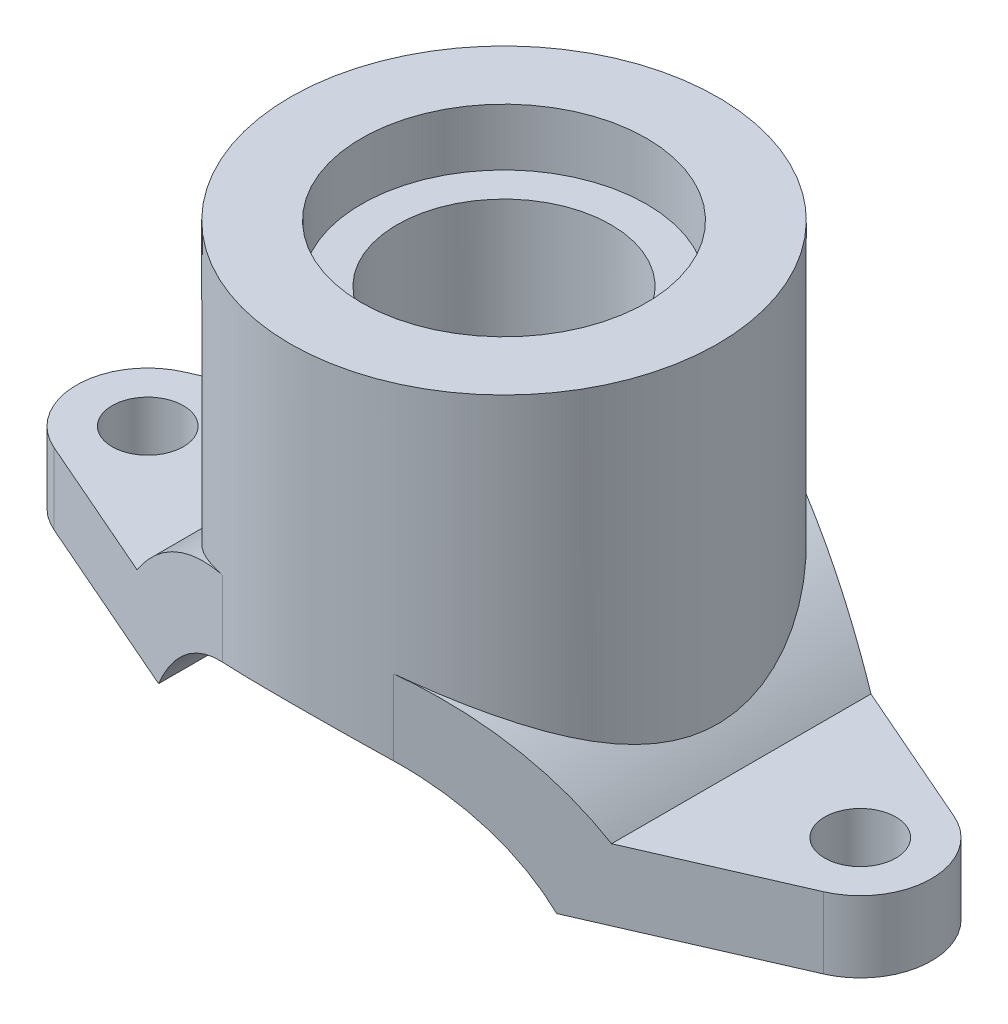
ISO-10303-21;
HEADER;
FILE_DESCRIPTION(('STEP AP214'),'2;1');
FILE_NAME('part.step','',(''),(''),'','','');
FILE_SCHEMA(('AUTOMOTIVE_DESIGN { 1 0 10303 214 1 1 1 1 }'));
ENDSEC;
DATA;
#1=APPLICATION_CONTEXT('core data for automotive mechanical design processes');
#2=APPLICATION_PROTOCOL_DEFINITION('international standard','automotive_design',2000,#1);
#3=PRODUCT_CONTEXT('',#1,'mechanical');
#4=PRODUCT('Part','Part','',(#3));
#5=PRODUCT_RELATED_PRODUCT_CATEGORY('part','',(#4));
#6=PRODUCT_DEFINITION_FORMATION('','',#4);
#7=PRODUCT_DEFINITION_CONTEXT('part definition',#1,'design');
#8=PRODUCT_DEFINITION('design','',#6,#7);
#9=PRODUCT_DEFINITION_SHAPE('','',#8);
#10=(LENGTH_UNIT() NAMED_UNIT(*) SI_UNIT(.MILLI.,.METRE.));
#11=(NAMED_UNIT(*) PLANE_ANGLE_UNIT() SI_UNIT($,.RADIAN.));
#12=(NAMED_UNIT(*) SI_UNIT($,.STERADIAN.) SOLID_ANGLE_UNIT());
#13=UNCERTAINTY_MEASURE_WITH_UNIT(LENGTH_MEASURE(1.E-05),#10,'distance_accuracy_value','');
#14=(GEOMETRIC_REPRESENTATION_CONTEXT(3) GLOBAL_UNCERTAINTY_ASSIGNED_CONTEXT((#13)) GLOBAL_UNIT_ASSIGNED_CONTEXT((#10,
#11,#12)) REPRESENTATION_CONTEXT('',''));
#15=CARTESIAN_POINT('',(0.,0.,0.));
#16=DIRECTION('',(0.,0.,1.));
#17=DIRECTION('',(1.,0.,0.));
#18=AXIS2_PLACEMENT_3D('',#15,#16,#17);
#19=CARTESIAN_POINT('',(0.,-39.,75.));
#20=DIRECTION('',(0.,0.,-1.));
#21=DIRECTION('',(-1.,0.,0.));
#22=AXIS2_PLACEMENT_3D('',#19,#20,#21);
#23=CYLINDRICAL_SURFACE('',#22,105.);
#24=CARTESIAN_POINT('',(0.,-39.,81.8317088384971));
#25=DIRECTION('',(-0.4,0.,0.916515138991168));
#26=DIRECTION('',(-0.916515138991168,0.,-0.4));
#27=AXIS2_PLACEMENT_3D('',#24,#25,#26);
#28=ELLIPSE('',#27,114.564392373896,105.);
#29=CARTESIAN_POINT('',(-30.,61.6230589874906,68.7386354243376));
#30=VERTEX_POINT('',#29);
#31=CARTESIAN_POINT('',(-83.240615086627,25.,45.5025260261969));
#32=VERTEX_POINT('',#31);
#33=EDGE_CURVE('E224',#30,#32,#28,.T.);
#34=ORIENTED_EDGE('',*,*,#33,.F.);
#35=CARTESIAN_POINT('',(0.,66.,75.));
#36=CARTESIAN_POINT('',(0.927941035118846,66.0000001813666,75.0000001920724));
#37=CARTESIAN_POINT('',(1.85587713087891,65.9876926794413,74.9827726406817));
#38=CARTESIAN_POINT('',(3.70991339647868,65.9385371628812,74.9139317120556));
#39=CARTESIAN_POINT('',(4.6360133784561,65.9016867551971,74.8623149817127));
#40=CARTESIAN_POINT('',(6.48425148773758,65.8036772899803,74.7249161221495));
#41=CARTESIAN_POINT('',(7.40639014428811,65.7425215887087,74.6391387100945));
#42=CARTESIAN_POINT('',(9.24508144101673,65.5962672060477,74.4337578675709));
#43=CARTESIAN_POINT('',(10.1616334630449,65.5111659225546,74.3141507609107));
#44=CARTESIAN_POINT('',(11.9874853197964,65.3175115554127,74.0415587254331));
#45=CARTESIAN_POINT('',(12.8967833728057,65.2089528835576,73.888565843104));
#46=CARTESIAN_POINT('',(14.7063098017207,64.9690220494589,73.5497916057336));
#47=CARTESIAN_POINT('',(15.6065371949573,64.8376474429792,73.3640067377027));
#48=CARTESIAN_POINT('',(17.3961496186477,64.5528602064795,72.9603680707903));
#49=CARTESIAN_POINT('',(18.2855356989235,64.3994497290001,72.7425174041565));
#50=CARTESIAN_POINT('',(20.0521720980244,64.0714202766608,72.2754820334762));
#51=CARTESIAN_POINT('',(20.9294211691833,63.8967991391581,72.0262941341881));
#52=CARTESIAN_POINT('',(22.6658131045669,63.5282615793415,71.4988101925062));
#53=CARTESIAN_POINT('',(23.5250266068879,63.3344507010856,71.2206729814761));
#54=CARTESIAN_POINT('',(25.2288633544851,62.9277783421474,70.6350925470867));
#55=CARTESIAN_POINT('',(26.0734852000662,62.7149150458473,70.3276465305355));
#56=CARTESIAN_POINT('',(28.5835996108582,62.0493564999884,69.3627420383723));
#57=CARTESIAN_POINT('',(30.2258008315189,61.5695941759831,68.6625768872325));
#58=CARTESIAN_POINT('',(33.4398608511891,60.5470805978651,67.1559915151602));
#59=CARTESIAN_POINT('',(35.0117209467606,60.004330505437,66.3495732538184));
#60=CARTESIAN_POINT('',(38.0800590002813,58.8651483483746,64.6374173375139));
#61=CARTESIAN_POINT('',(39.5765332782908,58.2687136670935,63.7316748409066));
#62=CARTESIAN_POINT('',(42.6205529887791,56.9763615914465,61.7420809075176));
#63=CARTESIAN_POINT('',(44.1606639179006,56.2763187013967,60.6495426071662));
#64=CARTESIAN_POINT('',(47.1427943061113,54.8365537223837,58.3617111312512));
#65=CARTESIAN_POINT('',(48.5848090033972,54.0968297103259,57.1664129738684));
#66=CARTESIAN_POINT('',(51.3698170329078,52.5895876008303,54.6775530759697));
#67=CARTESIAN_POINT('',(52.7126705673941,51.822032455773,53.3838576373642));
#68=CARTESIAN_POINT('',(55.2949626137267,50.2733621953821,50.7043317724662));
#69=CARTESIAN_POINT('',(56.5343953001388,49.4922463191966,49.3184961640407));
#70=CARTESIAN_POINT('',(58.4230617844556,48.249375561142,47.0420640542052));
#71=CARTESIAN_POINT('',(59.1068248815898,47.7873120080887,46.1800276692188));
#72=CARTESIAN_POINT('',(60.436662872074,46.8665455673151,44.4254607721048));
#73=CARTESIAN_POINT('',(61.0827357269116,46.4078428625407,43.5329286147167));
#74=CARTESIAN_POINT('',(62.3366260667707,45.4970162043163,41.7176498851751));
#75=CARTESIAN_POINT('',(62.9444315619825,45.0448943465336,40.7948939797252));
#76=CARTESIAN_POINT('',(64.120695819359,44.1509590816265,38.9199315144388));
#77=CARTESIAN_POINT('',(64.6891587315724,43.7091445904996,37.9677280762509));
#78=CARTESIAN_POINT('',(65.7852178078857,42.840048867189,36.0352250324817));
#79=CARTESIAN_POINT('',(66.3128603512,42.4127514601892,35.0549590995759));
#80=CARTESIAN_POINT('',(67.3267922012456,41.5762705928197,33.0658399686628));
#81=CARTESIAN_POINT('',(67.8130802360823,41.1670876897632,32.0569858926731));
#82=CARTESIAN_POINT('',(69.2074984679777,39.9735181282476,28.9890473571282));
#83=CARTESIAN_POINT('',(70.0520751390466,39.2223926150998,26.8870194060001));
#84=CARTESIAN_POINT('',(71.3153717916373,38.0687870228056,23.2705420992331));
#85=CARTESIAN_POINT('',(71.7837525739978,37.631803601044,21.7841612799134));
#86=CARTESIAN_POINT('',(72.6309207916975,36.8293459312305,18.7670670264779));
#87=CARTESIAN_POINT('',(73.0097225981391,36.4638602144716,17.2363607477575));
#88=CARTESIAN_POINT('',(73.6720269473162,35.8174238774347,14.1398142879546));
#89=CARTESIAN_POINT('',(73.9557033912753,35.536319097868,12.5740438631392));
#90=CARTESIAN_POINT('',(74.4240240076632,35.0687161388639,9.41360032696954));
#91=CARTESIAN_POINT('',(74.6086682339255,34.8822179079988,7.81892723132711));
#92=CARTESIAN_POINT('',(74.8762122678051,34.6110718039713,4.60164472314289));
#93=CARTESIAN_POINT('',(74.9584322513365,34.5271045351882,2.97892037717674));
#94=CARTESIAN_POINT('',(75.0171122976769,34.4672356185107,-0.270408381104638));
#95=CARTESIAN_POINT('',(74.9935756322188,34.4913306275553,-1.89701267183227));
#96=CARTESIAN_POINT('',(74.8412098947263,34.6464858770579,-5.14124333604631));
#97=CARTESIAN_POINT('',(74.7123059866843,34.7776221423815,-6.75886250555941));
#98=CARTESIAN_POINT('',(74.3518022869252,35.1409082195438,-9.97109938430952));
#99=CARTESIAN_POINT('',(74.1201908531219,35.3730694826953,-11.5657144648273));
#100=CARTESIAN_POINT('',(73.5226204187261,35.9641422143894,-14.9228139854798));
#101=CARTESIAN_POINT('',(73.1432797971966,36.3354559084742,-16.6807238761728));
#102=CARTESIAN_POINT('',(72.2666607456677,37.1767521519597,-20.1424915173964));
#103=CARTESIAN_POINT('',(71.7693642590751,37.6467498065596,-21.8463409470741));
#104=CARTESIAN_POINT('',(70.6632073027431,38.6677425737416,-25.1957951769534));
#105=CARTESIAN_POINT('',(70.0541444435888,39.2188842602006,-26.8412877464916));
#106=CARTESIAN_POINT('',(68.7315212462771,40.3835871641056,-30.066875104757));
#107=CARTESIAN_POINT('',(68.0179517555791,40.9971538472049,-31.6469641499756));
#108=CARTESIAN_POINT('',(66.7551036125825,42.0504801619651,-34.2057275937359));
#109=CARTESIAN_POINT('',(66.2340297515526,42.4772095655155,-35.2038906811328));
#110=CARTESIAN_POINT('',(65.1506116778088,43.3460976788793,-37.170662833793));
#111=CARTESIAN_POINT('',(64.5882686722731,43.7882559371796,-38.1392727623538));
#112=CARTESIAN_POINT('',(63.4232155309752,44.6841439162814,-40.0467868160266));
#113=CARTESIAN_POINT('',(62.8204940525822,45.1378768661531,-40.985682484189));
#114=CARTESIAN_POINT('',(61.5757055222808,46.0530966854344,-42.8330835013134));
#115=CARTESIAN_POINT('',(60.9336391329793,46.5145834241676,-43.7415893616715));
#116=CARTESIAN_POINT('',(59.6103462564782,47.4422355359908,-45.5284929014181));
#117=CARTESIAN_POINT('',(58.9290880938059,47.9084044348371,-46.406865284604));
#118=CARTESIAN_POINT('',(57.5285125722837,48.8417808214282,-48.1321597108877));
#119=CARTESIAN_POINT('',(56.8091949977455,49.3089883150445,-48.9790815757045));
#120=CARTESIAN_POINT('',(55.3331220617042,50.2412882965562,-50.6406992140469));
#121=CARTESIAN_POINT('',(54.5763701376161,50.7063809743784,-51.4553979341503));
#122=CARTESIAN_POINT('',(53.0258927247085,51.631504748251,-53.0517933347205));
#123=CARTESIAN_POINT('',(52.2321679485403,52.0915359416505,-53.833490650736));
#124=CARTESIAN_POINT('',(50.6001042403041,53.0082288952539,-55.3705565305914));
#125=CARTESIAN_POINT('',(49.7613982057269,53.4648108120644,-56.1255831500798));
#126=CARTESIAN_POINT('',(48.0473363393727,54.3669718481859,-57.5997502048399));
#127=CARTESIAN_POINT('',(47.1719810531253,54.812551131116,-58.3188911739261));
#128=CARTESIAN_POINT('',(45.3850572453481,55.6899545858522,-59.7200628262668));
#129=CARTESIAN_POINT('',(44.4734814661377,56.1217759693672,-60.4020860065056));
#130=CARTESIAN_POINT('',(42.6151617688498,56.9686953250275,-61.7272234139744));
#131=CARTESIAN_POINT('',(41.668422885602,57.3837956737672,-62.3703431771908));
#132=CARTESIAN_POINT('',(39.7422653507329,58.1938369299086,-63.6149728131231));
#133=CARTESIAN_POINT('',(38.7629074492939,58.588812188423,-64.2165542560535));
#134=CARTESIAN_POINT('',(36.7711735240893,59.3565950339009,-65.3774371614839));
#135=CARTESIAN_POINT('',(35.7588019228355,59.7294055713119,-65.9367442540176));
#136=CARTESIAN_POINT('',(33.7024890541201,60.4501318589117,-67.0110991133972));
#137=CARTESIAN_POINT('',(32.6585552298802,60.7980534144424,-67.5261572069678));
#138=CARTESIAN_POINT('',(30.540701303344,61.4664066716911,-68.5100658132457));
#139=CARTESIAN_POINT('',(29.4667836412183,61.7868406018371,-68.978920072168));
#140=CARTESIAN_POINT('',(26.7592494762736,62.546884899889,-70.08567553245));
#141=CARTESIAN_POINT('',(25.1083769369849,62.9682924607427,-70.6943400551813));
#142=CARTESIAN_POINT('',(21.7524623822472,63.7365236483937,-71.7979816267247));
#143=CARTESIAN_POINT('',(20.0474292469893,64.0833594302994,-72.2929772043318));
#144=CARTESIAN_POINT('',(16.593534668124,64.6953623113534,-73.1629947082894));
#145=CARTESIAN_POINT('',(14.8446978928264,64.9605743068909,-73.5380825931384));
#146=CARTESIAN_POINT('',(11.3138195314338,65.4038467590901,-74.1634135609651));
#147=CARTESIAN_POINT('',(9.53177701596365,65.5819047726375,-74.4136531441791));
#148=CARTESIAN_POINT('',(5.94177658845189,65.8472459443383,-74.7861094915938));
#149=CARTESIAN_POINT('',(4.13375385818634,65.934235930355,-74.9079127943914));
#150=CARTESIAN_POINT('',(0.511544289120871,66.0143797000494,-75.0201406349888));
#151=CARTESIAN_POINT('',(-1.30264253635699,66.0075336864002,-75.0105654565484));
#152=CARTESIAN_POINT('',(-4.92292171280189,65.9001659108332,-74.8601866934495));
#153=CARTESIAN_POINT('',(-6.72901329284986,65.7996354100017,-74.7193708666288));
#154=CARTESIAN_POINT('',(-10.318908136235,65.5072406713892,-74.3087082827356));
#155=CARTESIAN_POINT('',(-12.1027118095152,65.31537811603,-74.0388639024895));
#156=CARTESIAN_POINT('',(-15.5506424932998,64.8559435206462,-73.3900996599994));
#157=CARTESIAN_POINT('',(-17.2164157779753,64.5924261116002,-73.0170063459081));
#158=CARTESIAN_POINT('',(-20.5061231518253,63.9917215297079,-72.1622279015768));
#159=CARTESIAN_POINT('',(-22.1300589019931,63.6545372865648,-71.6805470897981));
#160=CARTESIAN_POINT('',(-25.3278886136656,62.9126722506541,-70.6140178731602));
#161=CARTESIAN_POINT('',(-26.9017782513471,62.5079856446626,-70.0291605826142));
#162=CARTESIAN_POINT('',(-29.9925812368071,61.6380800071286,-68.7621642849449));
#163=CARTESIAN_POINT('',(-31.5094912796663,61.172857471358,-68.0800196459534));
#164=CARTESIAN_POINT('',(-34.6157999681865,60.1446430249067,-66.5582676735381));
#165=CARTESIAN_POINT('',(-36.199278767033,59.5766095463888,-65.7099875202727));
#166=CARTESIAN_POINT('',(-39.2866049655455,58.3873701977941,-63.9120837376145));
#167=CARTESIAN_POINT('',(-40.790448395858,57.7661616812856,-62.9624550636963));
#168=CARTESIAN_POINT('',(-43.7155034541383,56.4804094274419,-60.9679451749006));
#169=CARTESIAN_POINT('',(-45.1366631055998,55.8158389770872,-59.9230050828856));
#170=CARTESIAN_POINT('',(-47.8924988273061,54.4541135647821,-57.744216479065));
#171=CARTESIAN_POINT('',(-49.2271704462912,53.7569569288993,-56.6103633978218));
#172=CARTESIAN_POINT('',(-52.0415269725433,52.2123928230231,-54.0456392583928));
#173=CARTESIAN_POINT('',(-53.5037222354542,51.3606330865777,-52.5981580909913));
#174=CARTESIAN_POINT('',(-56.301358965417,49.6445180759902,-49.5920769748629));
#175=CARTESIAN_POINT('',(-57.6367790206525,48.7801607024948,-48.0334583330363));
#176=CARTESIAN_POINT('',(-60.1779704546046,47.0579387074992,-44.8087993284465));
#177=CARTESIAN_POINT('',(-61.3836680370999,46.2000780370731,-43.1426986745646));
#178=CARTESIAN_POINT('',(-63.6599613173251,44.5129646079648,-39.707109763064));
#179=CARTESIAN_POINT('',(-64.7305808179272,43.6837068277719,-37.9376398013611));
#180=CARTESIAN_POINT('',(-66.5754671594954,42.2027204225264,-34.5801213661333));
#181=CARTESIAN_POINT('',(-67.369942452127,41.5434079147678,-33.006511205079));
#182=CARTESIAN_POINT('',(-68.8531926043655,40.2791733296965,-29.7888506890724));
#183=CARTESIAN_POINT('',(-69.5419684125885,39.674250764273,-28.1448009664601));
#184=CARTESIAN_POINT('',(-70.8063703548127,38.5382449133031,-24.7923675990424));
#185=CARTESIAN_POINT('',(-71.3821918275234,38.0070346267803,-23.0841012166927));
#186=CARTESIAN_POINT('',(-72.4146398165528,37.0369825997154,-19.6063100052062));
#187=CARTESIAN_POINT('',(-72.8712951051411,36.5981185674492,-17.8368000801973));
#188=CARTESIAN_POINT('',(-73.5842932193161,35.903612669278,-14.5804410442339));
#189=CARTESIAN_POINT('',(-73.8621018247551,35.6290704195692,-13.1023106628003));
#190=CARTESIAN_POINT('',(-74.3295447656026,35.1635230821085,-10.1191423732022));
#191=CARTESIAN_POINT('',(-74.5191900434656,34.9725076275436,-8.61410782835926));
#192=CARTESIAN_POINT('',(-74.8069701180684,34.681472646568,-5.58793054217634));
#193=CARTESIAN_POINT('',(-74.9051912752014,34.5813672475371,-4.0668043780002));
#194=CARTESIAN_POINT('',(-75.0085984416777,34.4759537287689,-1.01804101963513));
#195=CARTESIAN_POINT('',(-75.013783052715,34.4706470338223,0.509596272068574));
#196=CARTESIAN_POINT('',(-74.9310092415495,34.5550624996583,3.55971126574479));
#197=CARTESIAN_POINT('',(-74.8430484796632,34.6447870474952,5.08218883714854));
#198=CARTESIAN_POINT('',(-74.5756446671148,34.9155536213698,8.11076906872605));
#199=CARTESIAN_POINT('',(-74.3962019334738,35.0965953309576,9.61687178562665));
#200=CARTESIAN_POINT('',(-73.9486197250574,35.543284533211,12.6050518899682));
#201=CARTESIAN_POINT('',(-73.6803633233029,35.8090435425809,14.0870948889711));
#202=CARTESIAN_POINT('',(-73.0591966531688,36.4157930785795,17.0175918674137));
#203=CARTESIAN_POINT('',(-72.7062746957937,36.7567939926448,18.466041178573));
#204=CARTESIAN_POINT('',(-71.7867868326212,37.6301765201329,21.8081059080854));
#205=CARTESIAN_POINT('',(-71.1883484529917,38.1882562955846,23.6862870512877));
#206=CARTESIAN_POINT('',(-69.8571622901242,39.3950458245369,27.3643143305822));
#207=CARTESIAN_POINT('',(-69.1243670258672,40.0437875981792,29.1641324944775));
#208=CARTESIAN_POINT('',(-67.5319203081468,41.4085850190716,32.6829299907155));
#209=CARTESIAN_POINT('',(-66.6721090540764,42.124725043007,34.4018038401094));
#210=CARTESIAN_POINT('',(-64.8329718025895,43.6019182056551,37.7536790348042));
#211=CARTESIAN_POINT('',(-63.8536548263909,44.3629679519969,39.3866868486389));
#212=CARTESIAN_POINT('',(-61.752453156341,45.9317344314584,42.6078754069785));
#213=CARTESIAN_POINT('',(-60.6274444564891,46.7401556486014,44.193672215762));
#214=CARTESIAN_POINT('',(-58.2603611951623,48.3658513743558,47.270471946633));
#215=CARTESIAN_POINT('',(-57.0182864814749,49.1831258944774,48.7614747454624));
#216=CARTESIAN_POINT('',(-54.4196797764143,50.8100753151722,51.6455951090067));
#217=CARTESIAN_POINT('',(-53.0631115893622,51.6197477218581,53.0386814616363));
#218=CARTESIAN_POINT('',(-50.2381795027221,53.2158157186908,55.7218042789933));
#219=CARTESIAN_POINT('',(-48.769804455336,54.0022089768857,57.0118304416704));
#220=CARTESIAN_POINT('',(-46.3553445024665,55.2187915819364,58.9703438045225));
#221=CARTESIAN_POINT('',(-45.4447310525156,55.6616536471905,59.6750260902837));
#222=CARTESIAN_POINT('',(-43.5870243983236,56.5312655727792,61.0450903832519));
#223=CARTESIAN_POINT('',(-42.6399346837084,56.9580169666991,61.7104761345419));
#224=CARTESIAN_POINT('',(-40.7098221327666,57.7926459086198,63.0004617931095));
#225=CARTESIAN_POINT('',(-39.7267879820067,58.2005174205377,63.6250486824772));
#226=CARTESIAN_POINT('',(-37.7262841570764,58.9943124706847,64.8312536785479));
#227=CARTESIAN_POINT('',(-36.7088195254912,59.3802392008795,65.4128780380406));
#228=CARTESIAN_POINT('',(-34.6418328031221,60.1269364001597,66.5306114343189));
#229=CARTESIAN_POINT('',(-33.5923485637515,60.4877350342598,67.0667715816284));
#230=CARTESIAN_POINT('',(-31.4619911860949,61.1818241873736,68.0921455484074));
#231=CARTESIAN_POINT('',(-30.3811226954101,61.5151187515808,68.5813662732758));
#232=CARTESIAN_POINT('',(-28.1900707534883,62.1514756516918,69.5106874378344));
#233=CARTESIAN_POINT('',(-27.0798942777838,62.4545451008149,69.9507994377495));
#234=CARTESIAN_POINT('',(-24.8323470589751,63.0279337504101,70.779862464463));
#235=CARTESIAN_POINT('',(-23.694978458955,63.2982555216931,71.1688175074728));
#236=CARTESIAN_POINT('',(-21.6475792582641,63.7483703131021,71.8141256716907));
#237=CARTESIAN_POINT('',(-20.742310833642,63.9350242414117,72.0808639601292));
#238=CARTESIAN_POINT('',(-18.918296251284,64.2858191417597,72.5809355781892));
#239=CARTESIAN_POINT('',(-17.9995506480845,64.4499610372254,72.8142702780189));
#240=CARTESIAN_POINT('',(-16.1502870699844,64.7547410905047,73.2466368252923));
#241=CARTESIAN_POINT('',(-15.2197706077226,64.8953822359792,73.4456730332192));
#242=CARTESIAN_POINT('',(-13.3485741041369,65.152327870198,73.8086976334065));
#243=CARTESIAN_POINT('',(-12.4078939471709,65.2686320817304,73.9726856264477));
#244=CARTESIAN_POINT('',(-10.5189967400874,65.4760868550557,74.2648186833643));
#245=CARTESIAN_POINT('',(-9.57078626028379,65.5672572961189,74.3929920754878));
#246=CARTESIAN_POINT('',(-7.66806699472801,65.7239798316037,74.6131216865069));
#247=CARTESIAN_POINT('',(-6.71355826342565,65.7895321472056,74.7050782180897));
#248=CARTESIAN_POINT('',(-4.80027606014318,65.8945912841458,74.8523743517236));
#249=CARTESIAN_POINT('',(-3.84150253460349,65.9340977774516,74.9077134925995));
#250=CARTESIAN_POINT('',(-1.92181756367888,65.9868019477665,74.9815260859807));
#251=CARTESIAN_POINT('',(-0.960906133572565,65.9999998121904,74.9999998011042));
#252=CARTESIAN_POINT('',(0.,66.,75.));
#253=B_SPLINE_CURVE_WITH_KNOTS('',3,(#35,#36,#37,#38,#39,#40,#41,#42,#43,#44,#45,#46,#47,#48,
#49,#50,#51,#52,#53,#54,#55,#56,#57,#58,#59,#60,#61,#62,#63,#64,#65,#66,#67,#68,#69,#70,#71,#72,
#73,#74,#75,#76,#77,#78,#79,#80,#81,#82,#83,#84,#85,#86,#87,#88,#89,#90,#91,#92,#93,#94,#95,#96,
#97,#98,#99,#100,#101,#102,#103,#104,#105,#106,#107,#108,#109,#110,#111,#112,#113,#114,#115,
#116,#117,#118,#119,#120,#121,#122,#123,#124,#125,#126,#127,#128,#129,#130,#131,#132,#133,#134,
#135,#136,#137,#138,#139,#140,#141,#142,#143,#144,#145,#146,#147,#148,#149,#150,#151,#152,#153,
#154,#155,#156,#157,#158,#159,#160,#161,#162,#163,#164,#165,#166,#167,#168,#169,#170,#171,#172,
#173,#174,#175,#176,#177,#178,#179,#180,#181,#182,#183,#184,#185,#186,#187,#188,#189,#190,#191,
#192,#193,#194,#195,#196,#197,#198,#199,#200,#201,#202,#203,#204,#205,#206,#207,#208,#209,#210,
#211,#212,#213,#214,#215,#216,#217,#218,#219,#220,#221,#222,#223,#224,#225,#226,#227,#228,#229,
#230,#231,#232,#233,#234,#235,#236,#237,#238,#239,#240,#241,#242,#243,#244,#245,#246,#247,#248,
#249,#250,#251,#252),.UNSPECIFIED.,.T.,.F.,(4,2,2,2,2,2,2,2,2,2,2,2,2,2,2,2,2,2,2,2,2,2,2,2,2,2,
2,2,2,2,2,2,2,2,2,2,2,2,2,2,2,2,2,2,2,2,2,2,2,2,2,2,2,2,2,2,2,2,2,2,2,2,2,2,2,2,2,2,2,2,2,2,2,2,
2,2,2,2,2,2,2,2,2,2,2,2,2,2,2,2,2,2,2,2,2,2,2,2,2,2,2,2,2,2,2,2,2,2,4),(0.,2.78357364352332,
5.56741873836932,8.35087955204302,11.1346429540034,13.9190702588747,16.7037960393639,
19.488249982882,22.2729880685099,25.0431813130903,27.8136388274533,33.353086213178,
38.8924314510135,44.4320468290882,50.4679235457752,56.5040930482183,62.5486160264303,
68.5934792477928,72.1727428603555,75.7521998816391,79.3327728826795,82.9129676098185,
86.4890329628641,90.0652082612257,97.2117561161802,102.063453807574,106.914372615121,
111.75637435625,116.598373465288,121.472342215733,126.346160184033,131.223442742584,
136.10127829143,141.602168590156,147.103901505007,152.615697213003,158.12797592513,
161.739316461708,165.350551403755,168.962805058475,172.574997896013,176.190152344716,
179.805327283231,183.42017087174,187.034944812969,190.685908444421,194.336817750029,
197.988462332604,201.639586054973,205.284253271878,208.928434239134,212.571762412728,
216.214794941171,221.636596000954,227.057512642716,232.475442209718,237.893523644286,
243.328994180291,248.764452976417,254.200418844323,259.636284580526,264.812469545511,
269.988448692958,275.164873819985,280.341598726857,285.988253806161,291.635190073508,
297.285638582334,302.936377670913,309.610098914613,316.284945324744,322.963569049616,
329.641014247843,335.282598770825,340.924132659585,346.555822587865,352.186151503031,
356.768105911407,361.349491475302,365.926544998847,370.503667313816,375.080904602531,
379.658126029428,384.241397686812,388.825302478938,394.96219712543,401.101264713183,
407.248122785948,413.394517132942,419.706083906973,426.017658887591,432.331236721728,
438.645444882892,442.345334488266,446.0448710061,449.745582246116,453.44575381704,
457.141708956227,460.837119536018,464.531658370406,468.225906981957,471.111117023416,
473.996208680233,476.88093327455,479.76569072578,482.648159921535,485.530604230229,
488.413084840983,491.295544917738),.UNSPECIFIED.);
#254=CARTESIAN_POINT('',(-30.,61.6230589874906,-68.7386354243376));
#255=VERTEX_POINT('',#254);
#256=EDGE_CURVE('E139',#255,#30,#253,.T.);
#257=ORIENTED_EDGE('',*,*,#256,.F.);
#258=CARTESIAN_POINT('',(0.,-39.,-81.8317088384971));
#259=DIRECTION('',(-0.4,0.,-0.916515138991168));
#260=DIRECTION('',(0.916515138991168,0.,-0.4));
#261=AXIS2_PLACEMENT_3D('',#258,#259,#260);
#262=ELLIPSE('',#261,114.564392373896,105.);
#263=CARTESIAN_POINT('',(-83.240615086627,25.,-45.502526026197));
#264=VERTEX_POINT('',#263);
#265=EDGE_CURVE('E237',#264,#255,#262,.T.);
#266=ORIENTED_EDGE('',*,*,#265,.F.);
#267=DIRECTION('',(0.,0.,-1.));
#268=VECTOR('',#267,1.);
#269=CARTESIAN_POINT('',(-83.240615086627,25.,75.));
#270=LINE('',#269,#268);
#271=EDGE_CURVE('E228',#32,#264,#270,.T.);
#272=ORIENTED_EDGE('',*,*,#271,.F.);
#273=EDGE_LOOP('',(#34,#257,#266,#272));
#274=FACE_BOUND('',#273,.T.);
#275=ADVANCED_FACE('F34',(#274),#23,.T.);
#276=CARTESIAN_POINT('',(-150.,25.,75.));
#277=DIRECTION('',(0.,-1.,0.));
#278=DIRECTION('',(0.,0.,-1.));
#279=AXIS2_PLACEMENT_3D('',#276,#277,#278);
#280=PLANE('',#279);
#281=CARTESIAN_POINT('',(-125.,25.,0.));
#282=DIRECTION('',(0.,1.,0.));
#283=DIRECTION('',(0.,0.,1.));
#284=AXIS2_PLACEMENT_3D('',#281,#282,#283);
#285=CIRCLE('',#284,12.5);
#286=CARTESIAN_POINT('',(-125.,25.,12.5));
#287=VERTEX_POINT('',#286);
#288=EDGE_CURVE('E342',#287,#287,#285,.T.);
#289=ORIENTED_EDGE('',*,*,#288,.F.);
#290=EDGE_LOOP('',(#289));
#291=FACE_BOUND('',#290,.T.);
#292=DIRECTION('',(-0.916515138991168,0.,-0.4));
#293=VECTOR('',#292,1.);
#294=CARTESIAN_POINT('',(-128.504545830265,25.,25.7477270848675));
#295=LINE('',#294,#293);
#296=CARTESIAN_POINT('',(-135.,25.,22.9128784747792));
#297=VERTEX_POINT('',#296);
#298=EDGE_CURVE('E146',#32,#297,#295,.T.);
#299=ORIENTED_EDGE('',*,*,#298,.F.);
#300=ORIENTED_EDGE('',*,*,#271,.T.);
#301=DIRECTION('',(0.916515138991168,0.,-0.4));
#302=VECTOR('',#301,1.);
#303=CARTESIAN_POINT('',(-183.495454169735,25.,-1.74772708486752));
#304=LINE('',#303,#302);
#305=CARTESIAN_POINT('',(-135.,25.,-22.9128784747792));
#306=VERTEX_POINT('',#305);
#307=EDGE_CURVE('E256',#306,#264,#304,.T.);
#308=ORIENTED_EDGE('',*,*,#307,.F.);
#309=CARTESIAN_POINT('',(-125.,25.,0.));
#310=DIRECTION('',(0.,-1.,0.));
#311=DIRECTION('',(0.,0.,-1.));
#312=AXIS2_PLACEMENT_3D('',#309,#310,#311);
#313=CIRCLE('',#312,25.);
#314=EDGE_CURVE('E258',#297,#306,#313,.T.);
#315=ORIENTED_EDGE('',*,*,#314,.F.);
#316=EDGE_LOOP('',(#299,#300,#308,#315));
#317=FACE_BOUND('',#316,.T.);
#318=ADVANCED_FACE('F196',(#291,#317),#280,.F.);
#319=CARTESIAN_POINT('',(0.,-39.,-81.8317088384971));
#320=DIRECTION('',(0.4,0.,-0.916515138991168));
#321=DIRECTION('',(-0.916515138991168,0.,-0.4));
#322=AXIS2_PLACEMENT_3D('',#319,#320,#321);
#323=ELLIPSE('',#322,114.564392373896,105.);
#324=CARTESIAN_POINT('',(30.0000000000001,61.6230589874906,-68.7386354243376));
#325=VERTEX_POINT('',#324);
#326=CARTESIAN_POINT('',(83.240615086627,25.,-45.502526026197));
#327=VERTEX_POINT('',#326);
#328=EDGE_CURVE('E46',#325,#327,#323,.T.);
#329=ORIENTED_EDGE('',*,*,#328,.F.);
#330=CARTESIAN_POINT('',(30.,61.6230589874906,68.7386354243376));
#331=VERTEX_POINT('',#330);
#332=EDGE_CURVE('E128',#331,#325,#253,.T.);
#333=ORIENTED_EDGE('',*,*,#332,.F.);
#334=CARTESIAN_POINT('',(0.,-39.,81.8317088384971));
#335=DIRECTION('',(0.4,0.,0.916515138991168));
#336=DIRECTION('',(0.916515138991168,0.,-0.4));
#337=AXIS2_PLACEMENT_3D('',#334,#335,#336);
#338=ELLIPSE('',#337,114.564392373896,105.);
#339=CARTESIAN_POINT('',(83.240615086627,25.,45.502526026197));
#340=VERTEX_POINT('',#339);
#341=EDGE_CURVE('E132',#340,#331,#338,.T.);
#342=ORIENTED_EDGE('',*,*,#341,.F.);
#343=DIRECTION('',(0.,0.,-1.));
#344=VECTOR('',#343,1.);
#345=CARTESIAN_POINT('',(83.240615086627,25.,75.));
#346=LINE('',#345,#344);
#347=EDGE_CURVE('E248',#340,#327,#346,.T.);
#348=ORIENTED_EDGE('',*,*,#347,.T.);
#349=EDGE_LOOP('',(#329,#333,#342,#348));
#350=FACE_BOUND('',#349,.T.);
#351=ADVANCED_FACE('F130',(#350),#23,.T.);
#352=CARTESIAN_POINT('',(83.240615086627,25.,75.));
#353=DIRECTION('',(0.,-1.,0.));
#354=DIRECTION('',(0.,0.,-1.));
#355=AXIS2_PLACEMENT_3D('',#352,#353,#354);
#356=PLANE('',#355);
#357=CARTESIAN_POINT('',(125.,25.,0.));
#358=DIRECTION('',(0.,1.,0.));
#359=DIRECTION('',(0.,0.,1.));
#360=AXIS2_PLACEMENT_3D('',#357,#358,#359);
#361=CIRCLE('',#360,12.5);
#362=CARTESIAN_POINT('',(125.,25.,12.5));
#363=VERTEX_POINT('',#362);
#364=EDGE_CURVE('E340',#363,#363,#361,.T.);
#365=ORIENTED_EDGE('',*,*,#364,.F.);
#366=EDGE_LOOP('',(#365));
#367=FACE_BOUND('',#366,.T.);
#368=DIRECTION('',(0.916515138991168,0.,0.4));
#369=VECTOR('',#368,1.);
#370=CARTESIAN_POINT('',(127.417570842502,25.,-26.2221218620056));
#371=LINE('',#370,#369);
#372=CARTESIAN_POINT('',(135.,25.,-22.9128784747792));
#373=VERTEX_POINT('',#372);
#374=EDGE_CURVE('E242',#327,#373,#371,.T.);
#375=ORIENTED_EDGE('',*,*,#374,.F.);
#376=ORIENTED_EDGE('',*,*,#347,.F.);
#377=DIRECTION('',(-0.916515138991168,0.,0.4));
#378=VECTOR('',#377,1.);
#379=CARTESIAN_POINT('',(72.4266625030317,25.,50.2221218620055));
#380=LINE('',#379,#378);
#381=CARTESIAN_POINT('',(135.,25.,22.9128784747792));
#382=VERTEX_POINT('',#381);
#383=EDGE_CURVE('E145',#382,#340,#380,.T.);
#384=ORIENTED_EDGE('',*,*,#383,.F.);
#385=CARTESIAN_POINT('',(125.,25.,0.));
#386=DIRECTION('',(0.,-1.,0.));
#387=DIRECTION('',(0.,0.,-1.));
#388=AXIS2_PLACEMENT_3D('',#385,#386,#387);
#389=CIRCLE('',#388,25.);
#390=EDGE_CURVE('E12',#373,#382,#389,.T.);
#391=ORIENTED_EDGE('',*,*,#390,.F.);
#392=EDGE_LOOP('',(#375,#376,#384,#391));
#393=FACE_BOUND('',#392,.T.);
#394=ADVANCED_FACE('F189',(#367,#393),#356,.F.);
#395=CARTESIAN_POINT('',(125.,0.,0.));
#396=DIRECTION('',(0.,1.,0.));
#397=DIRECTION('',(-1.,0.,0.));
#398=AXIS2_PLACEMENT_3D('',#395,#396,#397);
#399=CYLINDRICAL_SURFACE('',#398,25.);
#400=CARTESIAN_POINT('',(125.,0.,0.));
#401=DIRECTION('',(0.,1.,0.));
#402=DIRECTION('',(-1.,0.,0.));
#403=AXIS2_PLACEMENT_3D('',#400,#401,#402);
#404=CIRCLE('',#403,25.);
#405=CARTESIAN_POINT('',(135.,0.,22.9128784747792));
#406=VERTEX_POINT('',#405);
#407=CARTESIAN_POINT('',(135.,0.,-22.9128784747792));
#408=VERTEX_POINT('',#407);
#409=EDGE_CURVE('E269',#406,#408,#404,.T.);
#410=ORIENTED_EDGE('',*,*,#409,.T.);
#411=DIRECTION('',(0.,1.,0.));
#412=VECTOR('',#411,1.);
#413=CARTESIAN_POINT('',(135.,0.,-22.9128784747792));
#414=LINE('',#413,#412);
#415=EDGE_CURVE('E156',#408,#373,#414,.T.);
#416=ORIENTED_EDGE('',*,*,#415,.T.);
#417=ORIENTED_EDGE('',*,*,#390,.T.);
#418=DIRECTION('',(0.,1.,0.));
#419=VECTOR('',#418,1.);
#420=CARTESIAN_POINT('',(135.,0.,22.9128784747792));
#421=LINE('',#420,#419);
#422=EDGE_CURVE('E153',#406,#382,#421,.T.);
#423=ORIENTED_EDGE('',*,*,#422,.F.);
#424=EDGE_LOOP('',(#410,#416,#417,#423));
#425=FACE_BOUND('',#424,.T.);
#426=ADVANCED_FACE('F185',(#425),#399,.T.);
#427=CARTESIAN_POINT('',(30.,0.,-68.7386354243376));
#428=DIRECTION('',(0.4,0.,-0.916515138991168));
#429=DIRECTION('',(-0.916515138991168,0.,-0.4));
#430=AXIS2_PLACEMENT_3D('',#427,#428,#429);
#431=PLANE('',#430);
#432=CARTESIAN_POINT('',(0.,-39.,-81.8317088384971));
#433=DIRECTION('',(0.4,0.,-0.916515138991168));
#434=DIRECTION('',(-0.916515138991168,0.,-0.4));
#435=AXIS2_PLACEMENT_3D('',#432,#433,#434);
#436=ELLIPSE('',#435,87.2871560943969,80.);
#437=CARTESIAN_POINT('',(69.8498389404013,0.,-51.3467398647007));
#438=VERTEX_POINT('',#437);
#439=CARTESIAN_POINT('',(30.0000000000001,35.1619848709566,-68.7386354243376));
#440=VERTEX_POINT('',#439);
#441=EDGE_CURVE('E245',#438,#440,#436,.F.);
#442=ORIENTED_EDGE('',*,*,#441,.T.);
#443=DIRECTION('',(0.,1.,0.));
#444=VECTOR('',#443,1.);
#445=CARTESIAN_POINT('',(30.0000000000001,0.,-68.7386354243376));
#446=LINE('',#445,#444);
#447=EDGE_CURVE('E264',#440,#325,#446,.T.);
#448=ORIENTED_EDGE('',*,*,#447,.T.);
#449=ORIENTED_EDGE('',*,*,#328,.T.);
#450=ORIENTED_EDGE('',*,*,#374,.T.);
#451=ORIENTED_EDGE('',*,*,#415,.F.);
#452=DIRECTION('',(-0.916515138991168,0.,-0.4));
#453=VECTOR('',#452,1.);
#454=CARTESIAN_POINT('',(30.,0.,-68.7386354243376));
#455=LINE('',#454,#453);
#456=EDGE_CURVE('E271',#408,#438,#455,.T.);
#457=ORIENTED_EDGE('',*,*,#456,.T.);
#458=EDGE_LOOP('',(#442,#448,#449,#450,#451,#457));
#459=FACE_BOUND('',#458,.T.);
#460=ADVANCED_FACE('F182',(#459),#431,.T.);
#461=CARTESIAN_POINT('',(135.,0.,22.9128784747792));
#462=DIRECTION('',(0.4,0.,0.916515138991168));
#463=DIRECTION('',(0.916515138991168,0.,-0.4));
#464=AXIS2_PLACEMENT_3D('',#461,#462,#463);
#465=PLANE('',#464);
#466=CARTESIAN_POINT('',(0.,-39.,81.8317088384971));
#467=DIRECTION('',(0.4,0.,0.916515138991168));
#468=DIRECTION('',(0.916515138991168,0.,-0.4));
#469=AXIS2_PLACEMENT_3D('',#466,#467,#468);
#470=ELLIPSE('',#469,87.2871560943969,80.);
#471=CARTESIAN_POINT('',(30.,35.1619848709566,68.7386354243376));
#472=VERTEX_POINT('',#471);
#473=CARTESIAN_POINT('',(69.8498389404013,0.,51.3467398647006));
#474=VERTEX_POINT('',#473);
#475=EDGE_CURVE('E53',#472,#474,#470,.F.);
#476=ORIENTED_EDGE('',*,*,#475,.T.);
#477=DIRECTION('',(0.916515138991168,0.,-0.4));
#478=VECTOR('',#477,1.);
#479=CARTESIAN_POINT('',(135.,0.,22.9128784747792));
#480=LINE('',#479,#478);
#481=EDGE_CURVE('E138',#474,#406,#480,.T.);
#482=ORIENTED_EDGE('',*,*,#481,.T.);
#483=ORIENTED_EDGE('',*,*,#422,.T.);
#484=ORIENTED_EDGE('',*,*,#383,.T.);
#485=ORIENTED_EDGE('',*,*,#341,.T.);
#486=DIRECTION('',(0.,1.,0.));
#487=VECTOR('',#486,1.);
#488=CARTESIAN_POINT('',(30.,0.,68.7386354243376));
#489=LINE('',#488,#487);
#490=EDGE_CURVE('E142',#472,#331,#489,.T.);
#491=ORIENTED_EDGE('',*,*,#490,.F.);
#492=EDGE_LOOP('',(#476,#482,#483,#484,#485,#491));
#493=FACE_BOUND('',#492,.T.);
#494=ADVANCED_FACE('F141',(#493),#465,.T.);
#495=CARTESIAN_POINT('',(-135.,0.,22.9128784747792));
#496=DIRECTION('',(-0.4,0.,0.916515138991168));
#497=DIRECTION('',(0.916515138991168,0.,0.4));
#498=AXIS2_PLACEMENT_3D('',#495,#496,#497);
#499=PLANE('',#498);
#500=CARTESIAN_POINT('',(0.,-39.,81.8317088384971));
#501=DIRECTION('',(-0.4,0.,0.916515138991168));
#502=DIRECTION('',(-0.916515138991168,0.,-0.4));
#503=AXIS2_PLACEMENT_3D('',#500,#501,#502);
#504=ELLIPSE('',#503,87.287156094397,80.);
#505=CARTESIAN_POINT('',(-69.8498389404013,0.,51.3467398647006));
#506=VERTEX_POINT('',#505);
#507=CARTESIAN_POINT('',(-30.,35.1619848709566,68.7386354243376));
#508=VERTEX_POINT('',#507);
#509=EDGE_CURVE('E233',#506,#508,#504,.F.);
#510=ORIENTED_EDGE('',*,*,#509,.T.);
#511=DIRECTION('',(0.,1.,0.));
#512=VECTOR('',#511,1.);
#513=CARTESIAN_POINT('',(-30.,0.,68.7386354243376));
#514=LINE('',#513,#512);
#515=EDGE_CURVE('E168',#508,#30,#514,.T.);
#516=ORIENTED_EDGE('',*,*,#515,.T.);
#517=ORIENTED_EDGE('',*,*,#33,.T.);
#518=ORIENTED_EDGE('',*,*,#298,.T.);
#519=DIRECTION('',(0.,1.,0.));
#520=VECTOR('',#519,1.);
#521=CARTESIAN_POINT('',(-135.,0.,22.9128784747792));
#522=LINE('',#521,#520);
#523=CARTESIAN_POINT('',(-135.,0.,22.9128784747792));
#524=VERTEX_POINT('',#523);
#525=EDGE_CURVE('E284',#524,#297,#522,.T.);
#526=ORIENTED_EDGE('',*,*,#525,.F.);
#527=DIRECTION('',(0.916515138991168,0.,0.4));
#528=VECTOR('',#527,1.);
#529=CARTESIAN_POINT('',(-135.,0.,22.9128784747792));
#530=LINE('',#529,#528);
#531=EDGE_CURVE('E154',#524,#506,#530,.T.);
#532=ORIENTED_EDGE('',*,*,#531,.T.);
#533=EDGE_LOOP('',(#510,#516,#517,#518,#526,#532));
#534=FACE_BOUND('',#533,.T.);
#535=ADVANCED_FACE('F192',(#534),#499,.T.);
#536=CARTESIAN_POINT('',(-125.,0.,0.));
#537=DIRECTION('',(0.,1.,0.));
#538=DIRECTION('',(-1.,0.,0.));
#539=AXIS2_PLACEMENT_3D('',#536,#537,#538);
#540=CYLINDRICAL_SURFACE('',#539,25.);
#541=DIRECTION('',(0.,1.,0.));
#542=VECTOR('',#541,1.);
#543=CARTESIAN_POINT('',(-135.,0.,-22.9128784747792));
#544=LINE('',#543,#542);
#545=CARTESIAN_POINT('',(-135.,0.,-22.9128784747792));
#546=VERTEX_POINT('',#545);
#547=EDGE_CURVE('E61',#546,#306,#544,.T.);
#548=ORIENTED_EDGE('',*,*,#547,.F.);
#549=CARTESIAN_POINT('',(-125.,0.,0.));
#550=DIRECTION('',(0.,1.,0.));
#551=DIRECTION('',(-1.,0.,0.));
#552=AXIS2_PLACEMENT_3D('',#549,#550,#551);
#553=CIRCLE('',#552,25.);
#554=EDGE_CURVE('E158',#546,#524,#553,.T.);
#555=ORIENTED_EDGE('',*,*,#554,.T.);
#556=ORIENTED_EDGE('',*,*,#525,.T.);
#557=ORIENTED_EDGE('',*,*,#314,.T.);
#558=EDGE_LOOP('',(#548,#555,#556,#557));
#559=FACE_BOUND('',#558,.T.);
#560=ADVANCED_FACE('F302',(#559),#540,.T.);
#561=CARTESIAN_POINT('',(-135.,0.,-22.9128784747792));
#562=DIRECTION('',(-0.4,0.,-0.916515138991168));
#563=DIRECTION('',(-0.916515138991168,0.,0.4));
#564=AXIS2_PLACEMENT_3D('',#561,#562,#563);
#565=PLANE('',#564);
#566=CARTESIAN_POINT('',(0.,-39.,-81.8317088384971));
#567=DIRECTION('',(-0.4,0.,-0.916515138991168));
#568=DIRECTION('',(0.916515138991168,0.,-0.4));
#569=AXIS2_PLACEMENT_3D('',#566,#567,#568);
#570=ELLIPSE('',#569,87.2871560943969,80.);
#571=CARTESIAN_POINT('',(-30.,35.1619848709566,-68.7386354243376));
#572=VERTEX_POINT('',#571);
#573=CARTESIAN_POINT('',(-69.8498389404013,0.,-51.3467398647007));
#574=VERTEX_POINT('',#573);
#575=EDGE_CURVE('E234',#572,#574,#570,.F.);
#576=ORIENTED_EDGE('',*,*,#575,.T.);
#577=DIRECTION('',(-0.916515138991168,0.,0.4));
#578=VECTOR('',#577,1.);
#579=CARTESIAN_POINT('',(-135.,0.,-22.9128784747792));
#580=LINE('',#579,#578);
#581=EDGE_CURVE('E280',#574,#546,#580,.T.);
#582=ORIENTED_EDGE('',*,*,#581,.T.);
#583=ORIENTED_EDGE('',*,*,#547,.T.);
#584=ORIENTED_EDGE('',*,*,#307,.T.);
#585=ORIENTED_EDGE('',*,*,#265,.T.);
#586=DIRECTION('',(0.,1.,0.));
#587=VECTOR('',#586,1.);
#588=CARTESIAN_POINT('',(-30.,0.,-68.7386354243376));
#589=LINE('',#588,#587);
#590=EDGE_CURVE('E288',#572,#255,#589,.T.);
#591=ORIENTED_EDGE('',*,*,#590,.F.);
#592=EDGE_LOOP('',(#576,#582,#583,#584,#585,#591));
#593=FACE_BOUND('',#592,.T.);
#594=ADVANCED_FACE('F180',(#593),#565,.T.);
#595=CARTESIAN_POINT('',(0.,0.,0.));
#596=DIRECTION('',(0.,1.,0.));
#597=DIRECTION('',(-1.,0.,0.));
#598=AXIS2_PLACEMENT_3D('',#595,#596,#597);
#599=CYLINDRICAL_SURFACE('',#598,75.);
#600=CARTESIAN_POINT('',(-30.,35.1619848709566,68.7386354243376));
#601=CARTESIAN_POINT('',(-29.3003452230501,35.4450166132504,69.0439963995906));
#602=CARTESIAN_POINT('',(-28.5931194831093,35.7195746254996,69.3399312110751));
#603=CARTESIAN_POINT('',(-27.1640794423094,36.2508716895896,69.9121235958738));
#604=CARTESIAN_POINT('',(-26.4422637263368,36.5076090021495,70.1883792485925));
#605=CARTESIAN_POINT('',(-24.9842189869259,37.002512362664,70.720516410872));
#606=CARTESIAN_POINT('',(-24.2479801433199,37.24066516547,70.9763833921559));
#607=CARTESIAN_POINT('',(-22.7624474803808,37.6972951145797,71.4666567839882));
#608=CARTESIAN_POINT('',(-22.0131540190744,37.9157727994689,71.7010637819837));
#609=CARTESIAN_POINT('',(-19.7437088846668,38.5412811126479,72.3717933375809));
#610=CARTESIAN_POINT('',(-18.2047847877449,38.9174344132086,72.774600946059));
#611=CARTESIAN_POINT('',(-15.086651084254,39.5807454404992,73.4843485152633));
#612=CARTESIAN_POINT('',(-13.5074512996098,39.867924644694,73.7913116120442));
#613=CARTESIAN_POINT('',(-10.3113417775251,40.349220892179,74.3054984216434));
#614=CARTESIAN_POINT('',(-8.69429503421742,40.5429162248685,74.5122701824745));
#615=CARTESIAN_POINT('',(-5.4412455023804,40.8314433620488,74.8201994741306));
#616=CARTESIAN_POINT('',(-3.80524125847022,40.9262675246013,74.9213488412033));
#617=CARTESIAN_POINT('',(-0.530097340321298,41.0149868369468,75.0159875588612));
#618=CARTESIAN_POINT('',(1.1090326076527,41.0090494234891,75.0096555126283));
#619=CARTESIAN_POINT('',(4.37978944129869,40.8967754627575,74.8898869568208));
#620=CARTESIAN_POINT('',(6.01141691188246,40.7904468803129,74.7764589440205));
#621=CARTESIAN_POINT('',(9.16761899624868,40.4879395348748,74.4535795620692));
#622=CARTESIAN_POINT('',(10.6932513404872,40.2968713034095,74.2495892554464));
#623=CARTESIAN_POINT('',(13.716554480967,39.8301705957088,73.7509559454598));
#624=CARTESIAN_POINT('',(15.2142233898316,39.5545324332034,73.4563068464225));
#625=CARTESIAN_POINT('',(18.1728428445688,38.9232736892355,72.7808423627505));
#626=CARTESIAN_POINT('',(19.6337892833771,38.5676442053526,72.4000173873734));
#627=CARTESIAN_POINT('',(22.5111508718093,37.7819719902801,71.5576292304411));
#628=CARTESIAN_POINT('',(23.9275810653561,37.3519547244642,71.0960936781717));
#629=CARTESIAN_POINT('',(26.1169886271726,36.6215008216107,70.310898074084));
#630=CARTESIAN_POINT('',(26.9068373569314,36.3439811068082,70.0123474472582));
#631=CARTESIAN_POINT('',(28.4673997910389,35.7682897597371,69.3924367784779));
#632=CARTESIAN_POINT('',(29.2381554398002,35.4701701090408,69.0711341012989));
#633=CARTESIAN_POINT('',(30.,35.1619848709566,68.7386354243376));
#634=B_SPLINE_CURVE_WITH_KNOTS('',3,(#600,#601,#602,#603,#604,#605,#606,#607,#608,#609,#610,
#611,#612,#613,#614,#615,#616,#617,#618,#619,#620,#621,#622,#623,#624,#625,#626,#627,#628,#629,
#630,#631,#632,#633),.UNSPECIFIED.,.F.,.F.,(4,2,2,2,2,2,2,2,2,2,2,2,2,2,2,2,4),(0.,
2.44240296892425,4.88504397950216,7.32941025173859,9.77370959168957,14.6716503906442,
19.5684079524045,24.4870532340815,29.4060786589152,34.3169308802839,39.2273935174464,
43.8751848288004,48.5232887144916,53.1719101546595,57.8189433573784,60.4847624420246,
63.1440843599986),.UNSPECIFIED.);
#635=EDGE_CURVE('E152',#508,#472,#634,.T.);
#636=ORIENTED_EDGE('',*,*,#635,.T.);
#637=ORIENTED_EDGE('',*,*,#490,.T.);
#638=ORIENTED_EDGE('',*,*,#332,.T.);
#639=ORIENTED_EDGE('',*,*,#447,.F.);
#640=CARTESIAN_POINT('',(30.0000000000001,35.1619848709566,-68.7386354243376));
#641=CARTESIAN_POINT('',(29.3003452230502,35.4450166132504,-69.0439963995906));
#642=CARTESIAN_POINT('',(28.5931194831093,35.7195746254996,-69.3399312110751));
#643=CARTESIAN_POINT('',(27.1640794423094,36.2508716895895,-69.9121235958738));
#644=CARTESIAN_POINT('',(26.4422637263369,36.5076090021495,-70.1883792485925));
#645=CARTESIAN_POINT('',(24.984218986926,37.002512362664,-70.720516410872));
#646=CARTESIAN_POINT('',(24.24798014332,37.24066516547,-70.976383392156));
#647=CARTESIAN_POINT('',(22.7624474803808,37.6972951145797,-71.4666567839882));
#648=CARTESIAN_POINT('',(22.0131540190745,37.9157727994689,-71.7010637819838));
#649=CARTESIAN_POINT('',(19.7437088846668,38.5412811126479,-72.3717933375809));
#650=CARTESIAN_POINT('',(18.204784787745,38.9174344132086,-72.774600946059));
#651=CARTESIAN_POINT('',(15.086651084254,39.5807454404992,-73.4843485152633));
#652=CARTESIAN_POINT('',(13.5074512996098,39.867924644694,-73.7913116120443));
#653=CARTESIAN_POINT('',(10.3113417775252,40.349220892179,-74.3054984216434));
#654=CARTESIAN_POINT('',(8.69429503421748,40.5429162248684,-74.5122701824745));
#655=CARTESIAN_POINT('',(5.44124550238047,40.8314433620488,-74.8201994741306));
#656=CARTESIAN_POINT('',(3.80524125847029,40.9262675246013,-74.9213488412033));
#657=CARTESIAN_POINT('',(0.530097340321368,41.0149868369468,-75.0159875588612));
#658=CARTESIAN_POINT('',(-1.10903260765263,41.0090494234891,-75.0096555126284));
#659=CARTESIAN_POINT('',(-4.37978944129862,40.8967754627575,-74.8898869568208));
#660=CARTESIAN_POINT('',(-6.01141691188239,40.7904468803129,-74.7764589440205));
#661=CARTESIAN_POINT('',(-9.1676189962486,40.4879395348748,-74.4535795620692));
#662=CARTESIAN_POINT('',(-10.6932513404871,40.2968713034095,-74.2495892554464));
#663=CARTESIAN_POINT('',(-13.7165544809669,39.8301705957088,-73.7509559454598));
#664=CARTESIAN_POINT('',(-15.2142233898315,39.5545324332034,-73.4563068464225));
#665=CARTESIAN_POINT('',(-18.1728428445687,38.9232736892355,-72.7808423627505));
#666=CARTESIAN_POINT('',(-19.633789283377,38.5676442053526,-72.4000173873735));
#667=CARTESIAN_POINT('',(-22.5111508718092,37.7819719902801,-71.5576292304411));
#668=CARTESIAN_POINT('',(-23.927581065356,37.3519547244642,-71.0960936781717));
#669=CARTESIAN_POINT('',(-26.1169886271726,36.6215008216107,-70.310898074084));
#670=CARTESIAN_POINT('',(-26.9068373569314,36.3439811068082,-70.0123474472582));
#671=CARTESIAN_POINT('',(-28.4673997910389,35.7682897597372,-69.392436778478));
#672=CARTESIAN_POINT('',(-29.2381554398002,35.4701701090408,-69.071134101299));
#673=CARTESIAN_POINT('',(-29.9999999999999,35.1619848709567,-68.7386354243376));
#674=B_SPLINE_CURVE_WITH_KNOTS('',3,(#640,#641,#642,#643,#644,#645,#646,#647,#648,#649,#650,
#651,#652,#653,#654,#655,#656,#657,#658,#659,#660,#661,#662,#663,#664,#665,#666,#667,#668,#669,
#670,#671,#672,#673),.UNSPECIFIED.,.F.,.F.,(4,2,2,2,2,2,2,2,2,2,2,2,2,2,2,2,4),(0.,
2.44240296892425,4.88504397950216,7.32941025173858,9.77370959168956,14.6716503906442,
19.5684079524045,24.4870532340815,29.4060786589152,34.3169308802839,39.2273935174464,
43.8751848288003,48.5232887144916,53.1719101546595,57.8189433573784,60.4847624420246,
63.1440843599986),.UNSPECIFIED.);
#675=EDGE_CURVE('E162',#440,#572,#674,.T.);
#676=ORIENTED_EDGE('',*,*,#675,.T.);
#677=ORIENTED_EDGE('',*,*,#590,.T.);
#678=ORIENTED_EDGE('',*,*,#256,.T.);
#679=ORIENTED_EDGE('',*,*,#515,.F.);
#680=EDGE_LOOP('',(#636,#637,#638,#639,#676,#677,#678,#679));
#681=FACE_BOUND('',#680,.T.);
#682=CARTESIAN_POINT('',(0.,150.,0.));
#683=DIRECTION('',(0.,1.,0.));
#684=DIRECTION('',(0.,0.,1.));
#685=AXIS2_PLACEMENT_3D('',#682,#683,#684);
#686=CIRCLE('',#685,75.);
#687=CARTESIAN_POINT('',(0.,150.,75.));
#688=VERTEX_POINT('',#687);
#689=EDGE_CURVE('E358',#688,#688,#686,.T.);
#690=ORIENTED_EDGE('',*,*,#689,.F.);
#691=EDGE_LOOP('',(#690));
#692=FACE_BOUND('',#691,.T.);
#693=ADVANCED_FACE('F148',(#681,#692),#599,.T.);
#694=CARTESIAN_POINT('',(-150.,0.,75.));
#695=DIRECTION('',(0.,1.,0.));
#696=DIRECTION('',(0.,0.,1.));
#697=AXIS2_PLACEMENT_3D('',#694,#695,#696);
#698=PLANE('',#697);
#699=CARTESIAN_POINT('',(-125.,0.,0.));
#700=DIRECTION('',(0.,1.,0.));
#701=DIRECTION('',(0.,0.,1.));
#702=AXIS2_PLACEMENT_3D('',#699,#700,#701);
#703=CIRCLE('',#702,12.5);
#704=CARTESIAN_POINT('',(-125.,0.,12.5));
#705=VERTEX_POINT('',#704);
#706=EDGE_CURVE('E345',#705,#705,#703,.T.);
#707=ORIENTED_EDGE('',*,*,#706,.T.);
#708=EDGE_LOOP('',(#707));
#709=FACE_BOUND('',#708,.T.);
#710=ORIENTED_EDGE('',*,*,#531,.F.);
#711=ORIENTED_EDGE('',*,*,#554,.F.);
#712=ORIENTED_EDGE('',*,*,#581,.F.);
#713=DIRECTION('',(0.,0.,-1.));
#714=VECTOR('',#713,1.);
#715=CARTESIAN_POINT('',(-69.8498389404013,0.,75.));
#716=LINE('',#715,#714);
#717=EDGE_CURVE('E253',#506,#574,#716,.T.);
#718=ORIENTED_EDGE('',*,*,#717,.F.);
#719=EDGE_LOOP('',(#710,#711,#712,#718));
#720=FACE_BOUND('',#719,.T.);
#721=ADVANCED_FACE('F36',(#709,#720),#698,.F.);
#722=CARTESIAN_POINT('',(0.,-39.,75.));
#723=DIRECTION('',(0.,0.,-1.));
#724=DIRECTION('',(-1.,0.,0.));
#725=AXIS2_PLACEMENT_3D('',#722,#723,#724);
#726=CYLINDRICAL_SURFACE('',#725,80.);
#727=CARTESIAN_POINT('',(0.,41.,-37.5));
#728=CARTESIAN_POINT('',(-0.993424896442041,40.9999942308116,-37.499993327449));
#729=CARTESIAN_POINT('',(-1.98702581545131,40.9814491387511,-37.4604750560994));
#730=CARTESIAN_POINT('',(-3.96700469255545,40.9077297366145,-37.3028148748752));
#731=CARTESIAN_POINT('',(-4.95337867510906,40.8525366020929,-37.1846325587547));
#732=CARTESIAN_POINT('',(-6.91303888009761,40.706819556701,-36.8706720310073));
#733=CARTESIAN_POINT('',(-7.88629567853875,40.6162266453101,-36.6747422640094));
#734=CARTESIAN_POINT('',(-9.81065263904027,40.4020679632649,-36.2074779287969));
#735=CARTESIAN_POINT('',(-10.7617554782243,40.2785061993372,-35.9361525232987));
#736=CARTESIAN_POINT('',(-12.6321460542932,40.0020212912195,-35.3220075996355));
#737=CARTESIAN_POINT('',(-13.5515391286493,39.8492092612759,-34.9794582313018));
#738=CARTESIAN_POINT('',(-15.3567185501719,39.5175999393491,-34.2254016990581));
#739=CARTESIAN_POINT('',(-16.242503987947,39.3388019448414,-33.8138926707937));
#740=CARTESIAN_POINT('',(-17.9753922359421,38.9594244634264,-32.9254179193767));
#741=CARTESIAN_POINT('',(-18.8225052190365,38.7588507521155,-32.4484695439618));
#742=CARTESIAN_POINT('',(-20.4741173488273,38.3403931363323,-31.4324779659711));
#743=CARTESIAN_POINT('',(-21.2786151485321,38.1225086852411,-30.893432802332));
#744=CARTESIAN_POINT('',(-22.884365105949,37.6618636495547,-29.725326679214));
#745=CARTESIAN_POINT('',(-23.6829981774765,37.4183939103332,-29.0929431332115));
#746=CARTESIAN_POINT('',(-25.2248095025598,36.9234137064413,-27.7667644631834));
#747=CARTESIAN_POINT('',(-25.9679859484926,36.6719029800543,-27.0729673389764));
#748=CARTESIAN_POINT('',(-27.3958010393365,36.1667732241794,-25.627186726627));
#749=CARTESIAN_POINT('',(-28.0804031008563,35.913152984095,-24.8751674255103));
#750=CARTESIAN_POINT('',(-29.0601473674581,35.5361014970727,-23.7068822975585));
#751=CARTESIAN_POINT('',(-29.3788818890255,35.4109754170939,-23.3107263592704));
#752=CARTESIAN_POINT('',(-30.0003457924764,35.1626000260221,-22.5052896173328));
#753=CARTESIAN_POINT('',(-30.3030704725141,35.0393512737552,-22.09600501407));
#754=CARTESIAN_POINT('',(-31.2252500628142,34.6576214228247,-20.7945277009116));
#755=CARTESIAN_POINT('',(-31.815490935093,34.4039264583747,-19.87995031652));
#756=CARTESIAN_POINT('',(-32.9162523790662,33.9169586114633,-17.9988222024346));
#757=CARTESIAN_POINT('',(-33.4267775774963,33.6836845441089,-17.0322744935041));
#758=CARTESIAN_POINT('',(-34.1292066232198,33.3551240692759,-15.5482138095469));
#759=CARTESIAN_POINT('',(-34.3527845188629,33.2491649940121,-15.047834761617));
#760=CARTESIAN_POINT('',(-34.7782812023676,33.0453108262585,-14.0364522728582));
#761=CARTESIAN_POINT('',(-34.9802055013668,32.9474136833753,-13.5254515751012));
#762=CARTESIAN_POINT('',(-35.3618799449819,32.7605924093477,-12.4935994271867));
#763=CARTESIAN_POINT('',(-35.5416295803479,32.6716684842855,-11.9727477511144));
#764=CARTESIAN_POINT('',(-35.8784072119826,32.5036727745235,-10.9221937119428));
#765=CARTESIAN_POINT('',(-36.0354340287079,32.4246015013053,-10.3924908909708));
#766=CARTESIAN_POINT('',(-36.4553073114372,32.2116983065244,-8.85153754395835));
#767=CARTESIAN_POINT('',(-36.6884170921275,32.0915316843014,-7.83005352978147));
#768=CARTESIAN_POINT('',(-37.0687044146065,31.8939852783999,-5.76726337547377));
#769=CARTESIAN_POINT('',(-37.215885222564,31.816603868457,-4.72595799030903));
#770=CARTESIAN_POINT('',(-37.4222204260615,31.7077869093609,-2.63292684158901));
#771=CARTESIAN_POINT('',(-37.4814344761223,31.6763202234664,-1.58120862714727));
#772=CARTESIAN_POINT('',(-37.5111108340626,31.6605756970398,0.523783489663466));
#773=CARTESIAN_POINT('',(-37.4815799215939,31.6762942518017,1.57705726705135));
#774=CARTESIAN_POINT('',(-37.3417818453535,31.7502403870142,3.56842468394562));
#775=CARTESIAN_POINT('',(-37.2400630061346,31.8039653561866,4.50730155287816));
#776=CARTESIAN_POINT('',(-36.9666841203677,31.9470793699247,6.37197603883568));
#777=CARTESIAN_POINT('',(-36.7950296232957,32.0364655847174,7.29777468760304));
#778=CARTESIAN_POINT('',(-36.3836145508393,32.2480593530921,9.13043388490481));
#779=CARTESIAN_POINT('',(-36.1438404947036,32.3702734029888,10.0372906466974));
#780=CARTESIAN_POINT('',(-35.5985823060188,32.6437985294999,11.8264869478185));
#781=CARTESIAN_POINT('',(-35.2930950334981,32.7951109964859,12.7088253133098));
#782=CARTESIAN_POINT('',(-34.6112591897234,33.1263305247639,14.4643547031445));
#783=CARTESIAN_POINT('',(-34.2334412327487,33.3068156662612,15.3368675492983));
#784=CARTESIAN_POINT('',(-33.6195730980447,33.5932174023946,16.6192379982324));
#785=CARTESIAN_POINT('',(-33.4070824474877,33.6913019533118,17.0423142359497));
#786=CARTESIAN_POINT('',(-32.9666849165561,33.8920865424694,17.8793553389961));
#787=CARTESIAN_POINT('',(-32.738775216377,33.9947874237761,18.2933185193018));
#788=CARTESIAN_POINT('',(-32.0324309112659,34.3088600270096,19.520880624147));
#789=CARTESIAN_POINT('',(-31.5314069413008,34.5261895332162,20.3200982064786));
#790=CARTESIAN_POINT('',(-30.472144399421,34.9714701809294,21.8765796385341));
#791=CARTESIAN_POINT('',(-29.9139017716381,35.1994220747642,22.6338405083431));
#792=CARTESIAN_POINT('',(-29.0036749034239,35.5580902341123,23.7762209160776));
#793=CARTESIAN_POINT('',(-28.6704407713,35.6869401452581,24.1769980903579));
#794=CARTESIAN_POINT('',(-27.9877817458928,35.9454287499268,24.964082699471));
#795=CARTESIAN_POINT('',(-27.6383603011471,36.0750672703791,25.3503931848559));
#796=CARTESIAN_POINT('',(-26.5663006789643,36.4639604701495,26.4871004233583));
#797=CARTESIAN_POINT('',(-25.8198457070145,36.7232013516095,27.2152999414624));
#798=CARTESIAN_POINT('',(-24.2673813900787,37.2349168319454,28.6082585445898));
#799=CARTESIAN_POINT('',(-23.4613502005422,37.4873889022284,29.2729941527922));
#800=CARTESIAN_POINT('',(-21.7939808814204,37.9790732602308,30.5346559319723));
#801=CARTESIAN_POINT('',(-20.9326426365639,38.2182855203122,31.1315819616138));
#802=CARTESIAN_POINT('',(-19.1269646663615,38.6856490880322,32.2736963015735));
#803=CARTESIAN_POINT('',(-18.1807456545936,38.9130818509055,32.8162138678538));
#804=CARTESIAN_POINT('',(-16.2396299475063,39.3406788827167,33.8188950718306));
#805=CARTESIAN_POINT('',(-15.2447314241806,39.5408421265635,34.2790556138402));
#806=CARTESIAN_POINT('',(-13.213697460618,39.9079362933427,35.1119944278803));
#807=CARTESIAN_POINT('',(-12.177585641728,40.0748859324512,35.4848219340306));
#808=CARTESIAN_POINT('',(-10.0715919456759,40.3706065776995,36.1390155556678));
#809=CARTESIAN_POINT('',(-9.00171343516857,40.4993813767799,36.4203907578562));
#810=CARTESIAN_POINT('',(-6.91920815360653,40.7065575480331,36.8703402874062));
#811=CARTESIAN_POINT('',(-5.90838032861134,40.7880348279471,37.0458425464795));
#812=CARTESIAN_POINT('',(-3.8734126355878,40.9126743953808,37.3135316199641));
#813=CARTESIAN_POINT('',(-2.84927343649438,40.9558386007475,37.4057226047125));
#814=CARTESIAN_POINT('',(-0.796326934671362,41.0026235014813,37.505622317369));
#815=CARTESIAN_POINT('',(0.232478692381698,41.0062574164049,37.5133592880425));
#816=CARTESIAN_POINT('',(2.28660413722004,40.9739107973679,37.4443235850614));
#817=CARTESIAN_POINT('',(3.31192407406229,40.9379316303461,37.367553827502));
#818=CARTESIAN_POINT('',(5.28307082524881,40.8310596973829,37.1383564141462));
#819=CARTESIAN_POINT('',(6.22966107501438,40.7626398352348,36.9912822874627));
#820=CARTESIAN_POINT('',(8.10602415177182,40.5938414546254,36.6258904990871));
#821=CARTESIAN_POINT('',(9.03579790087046,40.4934646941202,36.4075767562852));
#822=CARTESIAN_POINT('',(10.8726292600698,40.2631242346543,35.9018591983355));
#823=CARTESIAN_POINT('',(11.7796854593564,40.1331587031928,35.6144511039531));
#824=CARTESIAN_POINT('',(13.5656565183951,39.8466300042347,34.9731798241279));
#825=CARTESIAN_POINT('',(14.4445702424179,39.6900657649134,34.6193139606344));
#826=CARTESIAN_POINT('',(16.1957761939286,39.3486870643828,33.8362921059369));
#827=CARTESIAN_POINT('',(17.0670483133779,39.1631564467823,33.4051684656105));
#828=CARTESIAN_POINT('',(18.77002050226,38.7717803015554,32.4788546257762));
#829=CARTESIAN_POINT('',(19.6017201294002,38.5659345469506,31.9836637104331));
#830=CARTESIAN_POINT('',(21.2218565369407,38.1384144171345,30.9324358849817));
#831=CARTESIAN_POINT('',(22.0102780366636,37.916734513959,30.3763776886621));
#832=CARTESIAN_POINT('',(23.5400112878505,37.4624398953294,29.2069349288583));
#833=CARTESIAN_POINT('',(24.281320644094,37.2298246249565,28.5935474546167));
#834=CARTESIAN_POINT('',(25.777152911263,36.7377825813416,27.255860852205));
#835=CARTESIAN_POINT('',(26.527034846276,36.4778054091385,26.5265501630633));
#836=CARTESIAN_POINT('',(27.6040096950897,36.0877130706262,25.3878274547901));
#837=CARTESIAN_POINT('',(27.9550488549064,35.9576523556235,25.0007659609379));
#838=CARTESIAN_POINT('',(28.6408681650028,35.6982936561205,24.212059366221));
#839=CARTESIAN_POINT('',(28.975644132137,35.5689958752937,23.8104105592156));
#840=CARTESIAN_POINT('',(29.9549250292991,35.1835201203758,22.5842190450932));
#841=CARTESIAN_POINT('',(30.5742544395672,34.9298067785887,21.7385671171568));
#842=CARTESIAN_POINT('',(31.7415760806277,34.4361908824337,19.9955588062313));
#843=CARTESIAN_POINT('',(32.2895711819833,34.1962877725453,19.0982045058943));
#844=CARTESIAN_POINT('',(33.0635656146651,33.848364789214,17.7016040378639));
#845=CARTESIAN_POINT('',(33.3172356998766,33.7326178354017,17.2194415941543));
#846=CARTESIAN_POINT('',(33.8038311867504,33.5077428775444,16.2434091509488));
#847=CARTESIAN_POINT('',(34.0367614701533,33.3986133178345,15.749541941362));
#848=CARTESIAN_POINT('',(34.7037192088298,33.0825522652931,14.2512002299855));
#849=CARTESIAN_POINT('',(35.1059633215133,32.886925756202,13.2298959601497));
#850=CARTESIAN_POINT('',(35.8205213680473,32.5335531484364,11.1511165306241));
#851=CARTESIAN_POINT('',(36.1329189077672,32.3757718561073,10.0936760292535));
#852=CARTESIAN_POINT('',(36.6642360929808,32.1043117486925,7.94999942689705));
#853=CARTESIAN_POINT('',(36.8831679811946,31.9906271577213,6.86376711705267));
#854=CARTESIAN_POINT('',(37.2088538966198,31.8204183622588,4.77162438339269));
#855=CARTESIAN_POINT('',(37.3239753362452,31.7596480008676,3.76735486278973));
#856=CARTESIAN_POINT('',(37.4727243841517,31.6809887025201,1.75113324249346));
#857=CARTESIAN_POINT('',(37.5063571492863,31.663097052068,0.73918163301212));
#858=CARTESIAN_POINT('',(37.4916662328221,31.6708920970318,-1.28368947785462));
#859=CARTESIAN_POINT('',(37.4433629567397,31.6965679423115,-2.29460917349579));
#860=CARTESIAN_POINT('',(37.265508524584,31.790479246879,-4.30724829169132));
#861=CARTESIAN_POINT('',(37.1359593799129,31.858713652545,-5.30896794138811));
#862=CARTESIAN_POINT('',(36.8099469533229,32.0285767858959,-7.22133544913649));
#863=CARTESIAN_POINT('',(36.6191740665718,32.1273458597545,-8.13321760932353));
#864=CARTESIAN_POINT('',(36.1715151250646,32.3560411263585,-9.93652414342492));
#865=CARTESIAN_POINT('',(35.9146332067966,32.4859653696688,-10.8279497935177));
#866=CARTESIAN_POINT('',(35.3370987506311,32.7732077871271,-12.5855226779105));
#867=CARTESIAN_POINT('',(35.0164325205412,32.9305318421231,-13.4516644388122));
#868=CARTESIAN_POINT('',(34.3139901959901,33.2682631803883,-15.1541476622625));
#869=CARTESIAN_POINT('',(33.9322103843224,33.448671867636,-15.9904873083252));
#870=CARTESIAN_POINT('',(33.0829683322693,33.8405800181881,-17.6839766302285));
#871=CARTESIAN_POINT('',(32.6115015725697,34.0533481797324,-18.5388246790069));
#872=CARTESIAN_POINT('',(31.6054192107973,34.4942109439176,-20.2063309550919));
#873=CARTESIAN_POINT('',(31.0708016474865,34.7223060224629,-21.0189878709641));
#874=CARTESIAN_POINT('',(29.941352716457,35.1881973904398,-22.5988642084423));
#875=CARTESIAN_POINT('',(29.346497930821,35.4259974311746,-23.3660657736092));
#876=CARTESIAN_POINT('',(28.0998104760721,35.9055854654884,-24.8513755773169));
#877=CARTESIAN_POINT('',(27.4479750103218,36.1473736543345,-25.5694814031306));
#878=CARTESIAN_POINT('',(26.0212678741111,36.6539704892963,-27.0237668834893));
#879=CARTESIAN_POINT('',(25.2406254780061,36.918618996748,-27.75435476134));
#880=CARTESIAN_POINT('',(23.618021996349,37.4389622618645,-29.1476009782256));
#881=CARTESIAN_POINT('',(22.7760562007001,37.6946563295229,-29.8102540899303));
#882=CARTESIAN_POINT('',(21.034892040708,38.1903683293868,-31.0633922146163));
#883=CARTESIAN_POINT('',(20.1356628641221,38.4303776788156,-31.6538378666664));
#884=CARTESIAN_POINT('',(18.2855651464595,38.8880347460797,-32.7574129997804));
#885=CARTESIAN_POINT('',(17.3347002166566,39.1056840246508,-33.2705478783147));
#886=CARTESIAN_POINT('',(15.3917237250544,39.5116240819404,-34.2126441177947));
#887=CARTESIAN_POINT('',(14.3998240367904,39.7000464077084,-34.6419850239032));
#888=CARTESIAN_POINT('',(12.3773221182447,40.0433669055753,-35.4150235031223));
#889=CARTESIAN_POINT('',(11.3467140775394,40.1982600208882,-35.7587081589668));
#890=CARTESIAN_POINT('',(9.25763371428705,40.4695087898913,-36.3555127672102));
#891=CARTESIAN_POINT('',(8.19924235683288,40.5859653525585,-36.6088700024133));
#892=CARTESIAN_POINT('',(6.06131270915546,40.7772567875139,-37.0228933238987));
#893=CARTESIAN_POINT('',(4.98178884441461,40.8521190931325,-37.1836205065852));
#894=CARTESIAN_POINT('',(3.24989808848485,40.9365883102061,-37.3645732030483));
#895=CARTESIAN_POINT('',(2.60123728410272,40.960340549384,-37.4153300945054));
#896=CARTESIAN_POINT('',(1.30174287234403,40.9920484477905,-37.4830460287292));
#897=CARTESIAN_POINT('',(0.650909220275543,41.0000037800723,-37.5000043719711));
#898=CARTESIAN_POINT('',(0.,41.,-37.5));
#899=B_SPLINE_CURVE_WITH_KNOTS('',3,(#727,#728,#729,#730,#731,#732,#733,#734,#735,#736,#737,
#738,#739,#740,#741,#742,#743,#744,#745,#746,#747,#748,#749,#750,#751,#752,#753,#754,#755,#756,
#757,#758,#759,#760,#761,#762,#763,#764,#765,#766,#767,#768,#769,#770,#771,#772,#773,#774,#775,
#776,#777,#778,#779,#780,#781,#782,#783,#784,#785,#786,#787,#788,#789,#790,#791,#792,#793,#794,
#795,#796,#797,#798,#799,#800,#801,#802,#803,#804,#805,#806,#807,#808,#809,#810,#811,#812,#813,
#814,#815,#816,#817,#818,#819,#820,#821,#822,#823,#824,#825,#826,#827,#828,#829,#830,#831,#832,
#833,#834,#835,#836,#837,#838,#839,#840,#841,#842,#843,#844,#845,#846,#847,#848,#849,#850,#851,
#852,#853,#854,#855,#856,#857,#858,#859,#860,#861,#862,#863,#864,#865,#866,#867,#868,#869,#870,
#871,#872,#873,#874,#875,#876,#877,#878,#879,#880,#881,#882,#883,#884,#885,#886,#887,#888,#889,
#890,#891,#892,#893,#894,#895,#896,#897,#898),.UNSPECIFIED.,.T.,.F.,(4,2,2,2,2,2,2,2,2,2,2,2,2,
2,2,2,2,2,2,2,2,2,2,2,2,2,2,2,2,2,2,2,2,2,2,2,2,2,2,2,2,2,2,2,2,2,2,2,2,2,2,2,2,2,2,2,2,2,2,2,2,
2,2,2,2,2,2,2,2,2,2,2,2,2,2,2,2,2,2,2,2,2,2,2,2,4),(0.,2.97962709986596,5.96078588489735,
8.94778470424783,11.9344206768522,14.9099286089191,17.8855169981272,20.8603180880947,
23.8352131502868,26.9739533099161,30.1127957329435,33.2535844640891,34.8241161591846,
36.3951065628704,39.743750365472,43.0921997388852,44.7663314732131,46.4400361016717,
48.1137791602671,49.7876090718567,52.9466577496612,56.1055863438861,59.2623717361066,
62.4189159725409,65.2532748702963,68.0874089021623,70.9221041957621,73.7569349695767,
76.6570256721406,78.1072070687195,79.5576543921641,82.4587315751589,85.3600145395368,
86.9703354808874,88.5803149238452,91.8001674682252,95.0212065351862,98.2422523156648,
101.580428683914,104.918730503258,108.255145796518,111.591229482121,114.674708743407,
117.75803364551,120.840327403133,123.922514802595,126.800354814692,129.678036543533,
132.555896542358,135.433872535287,138.399652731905,141.365466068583,144.332319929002,
147.299324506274,150.529015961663,152.144081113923,153.75955950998,156.9910930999,
160.222496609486,161.892945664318,163.563000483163,166.902796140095,170.239473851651,
173.575714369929,176.609637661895,179.643368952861,182.676344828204,185.709245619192,
188.516678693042,191.323936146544,194.131796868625,196.939828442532,199.934189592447,
202.928643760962,205.924266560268,208.920036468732,212.220536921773,215.521291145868,
218.823836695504,222.12615157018,225.413142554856,228.700628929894,231.979414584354,
235.256035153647,237.208298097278,239.16060144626),.UNSPECIFIED.);
#900=CARTESIAN_POINT('',(0.,41.,-37.5));
#901=VERTEX_POINT('',#900);
#902=EDGE_CURVE('E38',#901,#901,#899,.T.);
#903=ORIENTED_EDGE('',*,*,#902,.T.);
#904=EDGE_LOOP('',(#903));
#905=FACE_BOUND('',#904,.T.);
#906=ORIENTED_EDGE('',*,*,#575,.F.);
#907=ORIENTED_EDGE('',*,*,#675,.F.);
#908=ORIENTED_EDGE('',*,*,#441,.F.);
#909=DIRECTION('',(0.,0.,-1.));
#910=VECTOR('',#909,1.);
#911=CARTESIAN_POINT('',(69.8498389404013,0.,75.));
#912=LINE('',#911,#910);
#913=EDGE_CURVE('E250',#474,#438,#912,.T.);
#914=ORIENTED_EDGE('',*,*,#913,.F.);
#915=ORIENTED_EDGE('',*,*,#475,.F.);
#916=ORIENTED_EDGE('',*,*,#635,.F.);
#917=ORIENTED_EDGE('',*,*,#509,.F.);
#918=ORIENTED_EDGE('',*,*,#717,.T.);
#919=EDGE_LOOP('',(#906,#907,#908,#914,#915,#916,#917,#918));
#920=FACE_BOUND('',#919,.T.);
#921=ADVANCED_FACE('F174',(#905,#920),#726,.F.);
#922=CARTESIAN_POINT('',(69.8498389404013,0.,75.));
#923=DIRECTION('',(0.,1.,0.));
#924=DIRECTION('',(0.,0.,1.));
#925=AXIS2_PLACEMENT_3D('',#922,#923,#924);
#926=PLANE('',#925);
#927=CARTESIAN_POINT('',(125.,0.,0.));
#928=DIRECTION('',(0.,1.,0.));
#929=DIRECTION('',(0.,0.,1.));
#930=AXIS2_PLACEMENT_3D('',#927,#928,#929);
#931=CIRCLE('',#930,12.5);
#932=CARTESIAN_POINT('',(125.,0.,12.5));
#933=VERTEX_POINT('',#932);
#934=EDGE_CURVE('E337',#933,#933,#931,.T.);
#935=ORIENTED_EDGE('',*,*,#934,.T.);
#936=EDGE_LOOP('',(#935));
#937=FACE_BOUND('',#936,.T.);
#938=ORIENTED_EDGE('',*,*,#456,.F.);
#939=ORIENTED_EDGE('',*,*,#409,.F.);
#940=ORIENTED_EDGE('',*,*,#481,.F.);
#941=ORIENTED_EDGE('',*,*,#913,.T.);
#942=EDGE_LOOP('',(#938,#939,#940,#941));
#943=FACE_BOUND('',#942,.T.);
#944=ADVANCED_FACE('F204',(#937,#943),#926,.F.);
#945=CARTESIAN_POINT('',(0.,150.,0.));
#946=DIRECTION('',(0.,1.,0.));
#947=DIRECTION('',(0.,0.,1.));
#948=AXIS2_PLACEMENT_3D('',#945,#946,#947);
#949=PLANE('',#948);
#950=CARTESIAN_POINT('',(0.,150.,0.));
#951=DIRECTION('',(0.,-1.,0.));
#952=DIRECTION('',(0.,0.,-1.));
#953=AXIS2_PLACEMENT_3D('',#950,#951,#952);
#954=CIRCLE('',#953,50.);
#955=CARTESIAN_POINT('',(0.,150.,-50.));
#956=VERTEX_POINT('',#955);
#957=EDGE_CURVE('E356',#956,#956,#954,.T.);
#958=ORIENTED_EDGE('',*,*,#957,.T.);
#959=EDGE_LOOP('',(#958));
#960=FACE_BOUND('',#959,.T.);
#961=ORIENTED_EDGE('',*,*,#689,.T.);
#962=EDGE_LOOP('',(#961));
#963=FACE_BOUND('',#962,.T.);
#964=ADVANCED_FACE('F206',(#960,#963),#949,.T.);
#965=CARTESIAN_POINT('',(0.,0.,0.));
#966=DIRECTION('',(0.,-1.,0.));
#967=DIRECTION('',(0.,0.,-1.));
#968=AXIS2_PLACEMENT_3D('',#965,#966,#967);
#969=CYLINDRICAL_SURFACE('',#968,37.5);
#970=CARTESIAN_POINT('',(0.,130.,0.));
#971=DIRECTION('',(0.,-1.,0.));
#972=DIRECTION('',(0.,0.,-1.));
#973=AXIS2_PLACEMENT_3D('',#970,#971,#972);
#974=CIRCLE('',#973,37.5);
#975=CARTESIAN_POINT('',(0.,130.,-37.5));
#976=VERTEX_POINT('',#975);
#977=EDGE_CURVE('E348',#976,#976,#974,.T.);
#978=ORIENTED_EDGE('',*,*,#977,.F.);
#979=EDGE_LOOP('',(#978));
#980=FACE_BOUND('',#979,.T.);
#981=ORIENTED_EDGE('',*,*,#902,.F.);
#982=EDGE_LOOP('',(#981));
#983=FACE_BOUND('',#982,.T.);
#984=ADVANCED_FACE('F212',(#980,#983),#969,.F.);
#985=CARTESIAN_POINT('',(0.,0.,0.));
#986=DIRECTION('',(0.,-1.,0.));
#987=DIRECTION('',(0.,0.,-1.));
#988=AXIS2_PLACEMENT_3D('',#985,#986,#987);
#989=CYLINDRICAL_SURFACE('',#988,50.);
#990=ORIENTED_EDGE('',*,*,#957,.F.);
#991=EDGE_LOOP('',(#990));
#992=FACE_BOUND('',#991,.T.);
#993=CARTESIAN_POINT('',(0.,130.,0.));
#994=DIRECTION('',(0.,-1.,0.));
#995=DIRECTION('',(0.,0.,-1.));
#996=AXIS2_PLACEMENT_3D('',#993,#994,#995);
#997=CIRCLE('',#996,50.);
#998=CARTESIAN_POINT('',(0.,130.,-50.));
#999=VERTEX_POINT('',#998);
#1000=EDGE_CURVE('E353',#999,#999,#997,.T.);
#1001=ORIENTED_EDGE('',*,*,#1000,.T.);
#1002=EDGE_LOOP('',(#1001));
#1003=FACE_BOUND('',#1002,.T.);
#1004=ADVANCED_FACE('F315',(#992,#1003),#989,.F.);
#1005=CARTESIAN_POINT('',(50.,130.,0.));
#1006=DIRECTION('',(0.,-1.,0.));
#1007=DIRECTION('',(0.,0.,-1.));
#1008=AXIS2_PLACEMENT_3D('',#1005,#1006,#1007);
#1009=PLANE('',#1008);
#1010=ORIENTED_EDGE('',*,*,#1000,.F.);
#1011=EDGE_LOOP('',(#1010));
#1012=FACE_BOUND('',#1011,.T.);
#1013=ORIENTED_EDGE('',*,*,#977,.T.);
#1014=EDGE_LOOP('',(#1013));
#1015=FACE_BOUND('',#1014,.T.);
#1016=ADVANCED_FACE('F318',(#1012,#1015),#1009,.F.);
#1017=CARTESIAN_POINT('',(-125.,0.,0.));
#1018=DIRECTION('',(0.,1.,0.));
#1019=DIRECTION('',(0.,0.,1.));
#1020=AXIS2_PLACEMENT_3D('',#1017,#1018,#1019);
#1021=CYLINDRICAL_SURFACE('',#1020,12.5);
#1022=ORIENTED_EDGE('',*,*,#706,.F.);
#1023=EDGE_LOOP('',(#1022));
#1024=FACE_BOUND('',#1023,.T.);
#1025=ORIENTED_EDGE('',*,*,#288,.T.);
#1026=EDGE_LOOP('',(#1025));
#1027=FACE_BOUND('',#1026,.T.);
#1028=ADVANCED_FACE('F321',(#1024,#1027),#1021,.F.);
#1029=CARTESIAN_POINT('',(125.,0.,0.));
#1030=DIRECTION('',(0.,1.,0.));
#1031=DIRECTION('',(0.,0.,1.));
#1032=AXIS2_PLACEMENT_3D('',#1029,#1030,#1031);
#1033=CYLINDRICAL_SURFACE('',#1032,12.5);
#1034=ORIENTED_EDGE('',*,*,#934,.F.);
#1035=EDGE_LOOP('',(#1034));
#1036=FACE_BOUND('',#1035,.T.);
#1037=ORIENTED_EDGE('',*,*,#364,.T.);
#1038=EDGE_LOOP('',(#1037));
#1039=FACE_BOUND('',#1038,.T.);
#1040=ADVANCED_FACE('F329',(#1036,#1039),#1033,.F.);
#1041=CLOSED_SHELL('',(#275,#318,#351,#394,#426,#460,#494,#535,#560,#594,#693,#721,#921,#944,
#964,#984,#1004,#1016,#1028,#1040));
#1042=MANIFOLD_SOLID_BREP('B2',#1041);
#1043=ADVANCED_BREP_SHAPE_REPRESENTATION('',(#18,#1042),#14);
#1044=SHAPE_DEFINITION_REPRESENTATION(#9,#1043);
ENDSEC;
END-ISO-10303-21;
